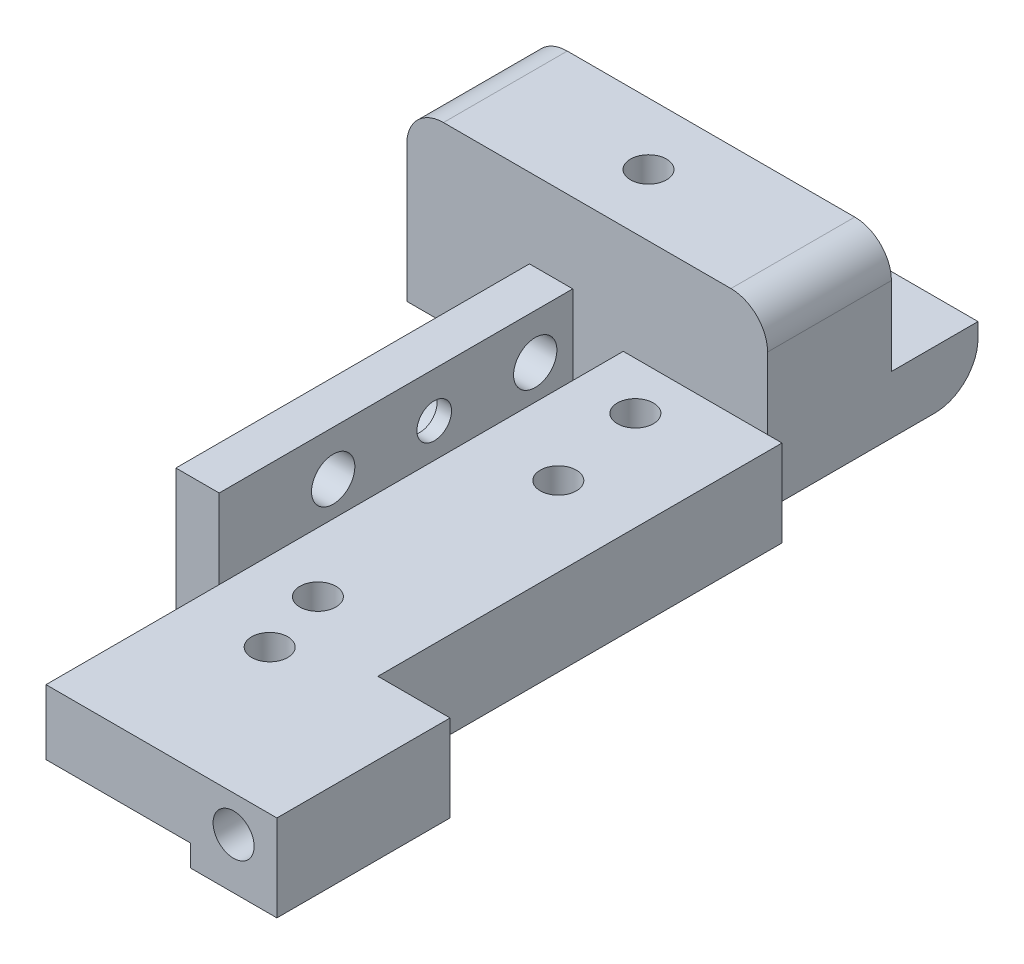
ISO-10303-21;
HEADER;
FILE_DESCRIPTION(('STEP AP214'),'2;1');
FILE_NAME('part.step','',(''),(''),'','','');
FILE_SCHEMA(('AUTOMOTIVE_DESIGN { 1 0 10303 214 1 1 1 1 }'));
ENDSEC;
DATA;
#1=APPLICATION_CONTEXT('core data for automotive mechanical design processes');
#2=APPLICATION_PROTOCOL_DEFINITION('international standard','automotive_design',2000,#1);
#3=PRODUCT_CONTEXT('',#1,'mechanical');
#4=PRODUCT('Part','Part','',(#3));
#5=PRODUCT_RELATED_PRODUCT_CATEGORY('part','',(#4));
#6=PRODUCT_DEFINITION_FORMATION('','',#4);
#7=PRODUCT_DEFINITION_CONTEXT('part definition',#1,'design');
#8=PRODUCT_DEFINITION('design','',#6,#7);
#9=PRODUCT_DEFINITION_SHAPE('','',#8);
#10=(LENGTH_UNIT() NAMED_UNIT(*) SI_UNIT(.MILLI.,.METRE.));
#11=(NAMED_UNIT(*) PLANE_ANGLE_UNIT() SI_UNIT($,.RADIAN.));
#12=(NAMED_UNIT(*) SI_UNIT($,.STERADIAN.) SOLID_ANGLE_UNIT());
#13=UNCERTAINTY_MEASURE_WITH_UNIT(LENGTH_MEASURE(1.E-05),#10,'distance_accuracy_value','');
#14=(GEOMETRIC_REPRESENTATION_CONTEXT(3) GLOBAL_UNCERTAINTY_ASSIGNED_CONTEXT((#13)) GLOBAL_UNIT_ASSIGNED_CONTEXT((#10,
#11,#12)) REPRESENTATION_CONTEXT('',''));
#15=CARTESIAN_POINT('',(0.,0.,0.));
#16=DIRECTION('',(0.,0.,1.));
#17=DIRECTION('',(1.,0.,0.));
#18=AXIS2_PLACEMENT_3D('',#15,#16,#17);
#19=CARTESIAN_POINT('',(11.,4.5,40.));
#20=DIRECTION('',(-1.,0.,0.));
#21=DIRECTION('',(0.,0.,1.));
#22=AXIS2_PLACEMENT_3D('',#19,#20,#21);
#23=PLANE('',#22);
#24=DIRECTION('',(0.,0.,1.));
#25=VECTOR('',#24,1.);
#26=CARTESIAN_POINT('',(11.,-1.5,0.));
#27=LINE('',#26,#25);
#28=CARTESIAN_POINT('',(11.,-1.5,0.));
#29=VERTEX_POINT('',#28);
#30=CARTESIAN_POINT('',(11.,-1.5,28.));
#31=VERTEX_POINT('',#30);
#32=EDGE_CURVE('E230',#29,#31,#27,.T.);
#33=ORIENTED_EDGE('',*,*,#32,.F.);
#34=DIRECTION('',(0.,-1.,0.));
#35=VECTOR('',#34,1.);
#36=CARTESIAN_POINT('',(11.,4.5,0.));
#37=LINE('',#36,#35);
#38=CARTESIAN_POINT('',(11.,4.5,0.));
#39=VERTEX_POINT('',#38);
#40=EDGE_CURVE('E333',#39,#29,#37,.T.);
#41=ORIENTED_EDGE('',*,*,#40,.F.);
#42=DIRECTION('',(0.,0.,-1.));
#43=VECTOR('',#42,1.);
#44=CARTESIAN_POINT('',(11.,4.5,40.));
#45=LINE('',#44,#43);
#46=CARTESIAN_POINT('',(11.,4.5,28.));
#47=VERTEX_POINT('',#46);
#48=EDGE_CURVE('E326',#47,#39,#45,.T.);
#49=ORIENTED_EDGE('',*,*,#48,.F.);
#50=DIRECTION('',(0.,1.,0.));
#51=VECTOR('',#50,1.);
#52=CARTESIAN_POINT('',(11.,-15.,28.));
#53=LINE('',#52,#51);
#54=EDGE_CURVE('E286',#31,#47,#53,.T.);
#55=ORIENTED_EDGE('',*,*,#54,.F.);
#56=EDGE_LOOP('',(#33,#41,#49,#55));
#57=FACE_BOUND('',#56,.T.);
#58=ADVANCED_FACE('F51',(#57),#23,.F.);
#59=CARTESIAN_POINT('',(11.,4.5,0.));
#60=DIRECTION('',(0.,0.,1.));
#61=DIRECTION('',(1.,0.,0.));
#62=AXIS2_PLACEMENT_3D('',#59,#60,#61);
#63=PLANE('',#62);
#64=DIRECTION('',(1.,0.,0.));
#65=VECTOR('',#64,1.);
#66=CARTESIAN_POINT('',(10.,-1.5,0.));
#67=LINE('',#66,#65);
#68=CARTESIAN_POINT('',(10.,-1.5,0.));
#69=VERTEX_POINT('',#68);
#70=EDGE_CURVE('E228',#69,#29,#67,.T.);
#71=ORIENTED_EDGE('',*,*,#70,.F.);
#72=DIRECTION('',(0.,1.,0.));
#73=VECTOR('',#72,1.);
#74=CARTESIAN_POINT('',(10.,-2.,0.));
#75=LINE('',#74,#73);
#76=CARTESIAN_POINT('',(10.,0.,0.));
#77=VERTEX_POINT('',#76);
#78=EDGE_CURVE('E291',#69,#77,#75,.T.);
#79=ORIENTED_EDGE('',*,*,#78,.T.);
#80=DIRECTION('',(0.,-1.,0.));
#81=VECTOR('',#80,1.);
#82=CARTESIAN_POINT('',(10.,0.,0.));
#83=LINE('',#82,#81);
#84=CARTESIAN_POINT('',(10.,4.5,0.));
#85=VERTEX_POINT('',#84);
#86=EDGE_CURVE('E430',#85,#77,#83,.T.);
#87=ORIENTED_EDGE('',*,*,#86,.F.);
#88=DIRECTION('',(-1.,0.,0.));
#89=VECTOR('',#88,1.);
#90=CARTESIAN_POINT('',(11.,4.5,0.));
#91=LINE('',#90,#89);
#92=EDGE_CURVE('E314',#39,#85,#91,.T.);
#93=ORIENTED_EDGE('',*,*,#92,.F.);
#94=ORIENTED_EDGE('',*,*,#40,.T.);
#95=EDGE_LOOP('',(#71,#79,#87,#93,#94));
#96=FACE_BOUND('',#95,.T.);
#97=ADVANCED_FACE('F364',(#96),#63,.F.);
#98=CARTESIAN_POINT('',(0.,4.5,40.));
#99=DIRECTION('',(0.,0.,-1.));
#100=DIRECTION('',(-1.,0.,0.));
#101=AXIS2_PLACEMENT_3D('',#98,#99,#100);
#102=PLANE('',#101);
#103=CARTESIAN_POINT('',(13.,2.,40.));
#104=DIRECTION('',(0.,0.,1.));
#105=DIRECTION('',(1.,0.,0.));
#106=AXIS2_PLACEMENT_3D('',#103,#104,#105);
#107=CIRCLE('',#106,1.42239999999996);
#108=CARTESIAN_POINT('',(14.4224,2.,40.));
#109=VERTEX_POINT('',#108);
#110=EDGE_CURVE('E265',#109,#109,#107,.T.);
#111=ORIENTED_EDGE('',*,*,#110,.F.);
#112=EDGE_LOOP('',(#111));
#113=FACE_BOUND('',#112,.T.);
#114=DIRECTION('',(-1.,0.,0.));
#115=VECTOR('',#114,1.);
#116=CARTESIAN_POINT('',(16.,-1.5,40.));
#117=LINE('',#116,#115);
#118=CARTESIAN_POINT('',(16.,-1.5,40.));
#119=VERTEX_POINT('',#118);
#120=CARTESIAN_POINT('',(10.,-1.5,40.));
#121=VERTEX_POINT('',#120);
#122=EDGE_CURVE('E219',#119,#121,#117,.T.);
#123=ORIENTED_EDGE('',*,*,#122,.F.);
#124=DIRECTION('',(0.,1.,0.));
#125=VECTOR('',#124,1.);
#126=CARTESIAN_POINT('',(16.,-15.,40.));
#127=LINE('',#126,#125);
#128=CARTESIAN_POINT('',(16.,4.5,40.));
#129=VERTEX_POINT('',#128);
#130=EDGE_CURVE('E338',#119,#129,#127,.T.);
#131=ORIENTED_EDGE('',*,*,#130,.T.);
#132=DIRECTION('',(1.,0.,0.));
#133=VECTOR('',#132,1.);
#134=CARTESIAN_POINT('',(0.,4.5,40.));
#135=LINE('',#134,#133);
#136=CARTESIAN_POINT('',(0.,4.5,40.));
#137=VERTEX_POINT('',#136);
#138=EDGE_CURVE('E322',#137,#129,#135,.T.);
#139=ORIENTED_EDGE('',*,*,#138,.F.);
#140=DIRECTION('',(0.,-1.,0.));
#141=VECTOR('',#140,1.);
#142=CARTESIAN_POINT('',(0.,4.5,40.));
#143=LINE('',#142,#141);
#144=CARTESIAN_POINT('',(0.,0.,40.));
#145=VERTEX_POINT('',#144);
#146=EDGE_CURVE('E532',#137,#145,#143,.T.);
#147=ORIENTED_EDGE('',*,*,#146,.T.);
#148=DIRECTION('',(1.,0.,0.));
#149=VECTOR('',#148,1.);
#150=CARTESIAN_POINT('',(0.,0.,40.));
#151=LINE('',#150,#149);
#152=CARTESIAN_POINT('',(10.,0.,40.));
#153=VERTEX_POINT('',#152);
#154=EDGE_CURVE('E301',#145,#153,#151,.T.);
#155=ORIENTED_EDGE('',*,*,#154,.T.);
#156=DIRECTION('',(0.,1.,0.));
#157=VECTOR('',#156,1.);
#158=CARTESIAN_POINT('',(10.,-2.,40.));
#159=LINE('',#158,#157);
#160=EDGE_CURVE('E295',#121,#153,#159,.T.);
#161=ORIENTED_EDGE('',*,*,#160,.F.);
#162=EDGE_LOOP('',(#123,#131,#139,#147,#155,#161));
#163=FACE_BOUND('',#162,.T.);
#164=ADVANCED_FACE('F370',(#113,#163),#102,.F.);
#165=CARTESIAN_POINT('',(10.,-2.,40.));
#166=DIRECTION('',(1.,0.,0.));
#167=DIRECTION('',(0.,0.,-1.));
#168=AXIS2_PLACEMENT_3D('',#165,#166,#167);
#169=PLANE('',#168);
#170=DIRECTION('',(0.,0.,-1.));
#171=VECTOR('',#170,1.);
#172=CARTESIAN_POINT('',(10.,-1.5,40.));
#173=LINE('',#172,#171);
#174=EDGE_CURVE('E222',#121,#69,#173,.T.);
#175=ORIENTED_EDGE('',*,*,#174,.F.);
#176=ORIENTED_EDGE('',*,*,#160,.T.);
#177=DIRECTION('',(0.,0.,-1.));
#178=VECTOR('',#177,1.);
#179=CARTESIAN_POINT('',(10.,0.,40.));
#180=LINE('',#179,#178);
#181=EDGE_CURVE('E304',#153,#77,#180,.T.);
#182=ORIENTED_EDGE('',*,*,#181,.T.);
#183=ORIENTED_EDGE('',*,*,#78,.F.);
#184=EDGE_LOOP('',(#175,#176,#182,#183));
#185=FACE_BOUND('',#184,.T.);
#186=ADVANCED_FACE('F378',(#185),#169,.F.);
#187=CARTESIAN_POINT('',(16.,-15.,40.));
#188=DIRECTION('',(1.,0.,0.));
#189=DIRECTION('',(0.,0.,-1.));
#190=AXIS2_PLACEMENT_3D('',#187,#188,#189);
#191=PLANE('',#190);
#192=ORIENTED_EDGE('',*,*,#130,.F.);
#193=DIRECTION('',(0.,0.,1.));
#194=VECTOR('',#193,1.);
#195=CARTESIAN_POINT('',(16.,-1.5,28.));
#196=LINE('',#195,#194);
#197=CARTESIAN_POINT('',(16.,-1.5,28.));
#198=VERTEX_POINT('',#197);
#199=EDGE_CURVE('E234',#198,#119,#196,.T.);
#200=ORIENTED_EDGE('',*,*,#199,.F.);
#201=DIRECTION('',(0.,1.,0.));
#202=VECTOR('',#201,1.);
#203=CARTESIAN_POINT('',(16.,-15.,28.));
#204=LINE('',#203,#202);
#205=CARTESIAN_POINT('',(16.,4.5,28.));
#206=VERTEX_POINT('',#205);
#207=EDGE_CURVE('E283',#198,#206,#204,.T.);
#208=ORIENTED_EDGE('',*,*,#207,.T.);
#209=DIRECTION('',(0.,0.,-1.));
#210=VECTOR('',#209,1.);
#211=CARTESIAN_POINT('',(16.,4.5,40.));
#212=LINE('',#211,#210);
#213=EDGE_CURVE('E277',#129,#206,#212,.T.);
#214=ORIENTED_EDGE('',*,*,#213,.F.);
#215=EDGE_LOOP('',(#192,#200,#208,#214));
#216=FACE_BOUND('',#215,.T.);
#217=ADVANCED_FACE('F359',(#216),#191,.T.);
#218=CARTESIAN_POINT('',(16.,-15.,28.));
#219=DIRECTION('',(0.,0.,-1.));
#220=DIRECTION('',(-1.,0.,0.));
#221=AXIS2_PLACEMENT_3D('',#218,#219,#220);
#222=PLANE('',#221);
#223=CARTESIAN_POINT('',(13.5,2.,28.));
#224=DIRECTION('',(0.,0.,-1.));
#225=DIRECTION('',(-1.,0.,0.));
#226=AXIS2_PLACEMENT_3D('',#223,#224,#225);
#227=CIRCLE('',#226,1.5875);
#228=CARTESIAN_POINT('',(11.9125,2.,28.));
#229=VERTEX_POINT('',#228);
#230=EDGE_CURVE('E262',#229,#229,#227,.T.);
#231=ORIENTED_EDGE('',*,*,#230,.F.);
#232=EDGE_LOOP('',(#231));
#233=FACE_BOUND('',#232,.T.);
#234=ORIENTED_EDGE('',*,*,#207,.F.);
#235=DIRECTION('',(1.,0.,0.));
#236=VECTOR('',#235,1.);
#237=CARTESIAN_POINT('',(11.,-1.5,28.));
#238=LINE('',#237,#236);
#239=EDGE_CURVE('E232',#31,#198,#238,.T.);
#240=ORIENTED_EDGE('',*,*,#239,.F.);
#241=ORIENTED_EDGE('',*,*,#54,.T.);
#242=DIRECTION('',(-1.,0.,0.));
#243=VECTOR('',#242,1.);
#244=CARTESIAN_POINT('',(16.,4.5,28.));
#245=LINE('',#244,#243);
#246=EDGE_CURVE('E280',#206,#47,#245,.T.);
#247=ORIENTED_EDGE('',*,*,#246,.F.);
#248=EDGE_LOOP('',(#234,#240,#241,#247));
#249=FACE_BOUND('',#248,.T.);
#250=ADVANCED_FACE('F348',(#233,#249),#222,.T.);
#251=CARTESIAN_POINT('',(13.,2.,31.13));
#252=DIRECTION('',(0.,0.,1.));
#253=DIRECTION('',(1.,0.,0.));
#254=AXIS2_PLACEMENT_3D('',#251,#252,#253);
#255=CONICAL_SURFACE('',#254,1.1303,1.02974425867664);
#256=CARTESIAN_POINT('',(13.,2.,31.13));
#257=DIRECTION('',(0.,0.,1.));
#258=DIRECTION('',(1.,0.,0.));
#259=AXIS2_PLACEMENT_3D('',#256,#257,#258);
#260=CIRCLE('',#259,1.1303);
#261=CARTESIAN_POINT('',(14.1303,2.,31.13));
#262=VERTEX_POINT('',#261);
#263=EDGE_CURVE('E274',#262,#262,#260,.T.);
#264=ORIENTED_EDGE('',*,*,#263,.T.);
#265=EDGE_LOOP('',(#264));
#266=FACE_BOUND('',#265,.T.);
#267=CARTESIAN_POINT('',(13.,2.,31.));
#268=DIRECTION('',(0.,0.,-1.));
#269=DIRECTION('',(-1.,0.,0.));
#270=AXIS2_PLACEMENT_3D('',#267,#268,#269);
#271=CIRCLE('',#270,0.913943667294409);
#272=CARTESIAN_POINT('',(12.0860563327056,2.,31.));
#273=VERTEX_POINT('',#272);
#274=EDGE_CURVE('E261',#273,#273,#271,.F.);
#275=ORIENTED_EDGE('',*,*,#274,.F.);
#276=EDGE_LOOP('',(#275));
#277=FACE_BOUND('',#276,.T.);
#278=ADVANCED_FACE('F345',(#266,#277),#255,.F.);
#279=CARTESIAN_POINT('',(0.,4.5,0.));
#280=DIRECTION('',(1.,0.,0.));
#281=DIRECTION('',(0.,0.,-1.));
#282=AXIS2_PLACEMENT_3D('',#279,#280,#281);
#283=PLANE('',#282);
#284=DIRECTION('',(0.,0.,1.));
#285=VECTOR('',#284,1.);
#286=CARTESIAN_POINT('',(0.,4.5,0.));
#287=LINE('',#286,#285);
#288=CARTESIAN_POINT('',(0.,4.5,28.));
#289=VERTEX_POINT('',#288);
#290=EDGE_CURVE('E317',#289,#137,#287,.T.);
#291=ORIENTED_EDGE('',*,*,#290,.F.);
#292=DIRECTION('',(0.,-1.,0.));
#293=VECTOR('',#292,1.);
#294=CARTESIAN_POINT('',(0.,0.,28.));
#295=LINE('',#294,#293);
#296=CARTESIAN_POINT('',(0.,0.,28.));
#297=VERTEX_POINT('',#296);
#298=EDGE_CURVE('E463',#289,#297,#295,.T.);
#299=ORIENTED_EDGE('',*,*,#298,.T.);
#300=DIRECTION('',(0.,0.,1.));
#301=VECTOR('',#300,1.);
#302=CARTESIAN_POINT('',(0.,0.,0.));
#303=LINE('',#302,#301);
#304=EDGE_CURVE('E294',#297,#145,#303,.T.);
#305=ORIENTED_EDGE('',*,*,#304,.T.);
#306=ORIENTED_EDGE('',*,*,#146,.F.);
#307=EDGE_LOOP('',(#291,#299,#305,#306));
#308=FACE_BOUND('',#307,.T.);
#309=ADVANCED_FACE('F347',(#308),#283,.F.);
#310=CARTESIAN_POINT('',(0.,0.,0.));
#311=DIRECTION('',(0.,1.,0.));
#312=DIRECTION('',(0.,0.,1.));
#313=AXIS2_PLACEMENT_3D('',#310,#311,#312);
#314=PLANE('',#313);
#315=CARTESIAN_POINT('',(4.14000000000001,0.,3.3));
#316=DIRECTION('',(0.,1.,0.));
#317=DIRECTION('',(0.,0.,1.));
#318=AXIS2_PLACEMENT_3D('',#315,#316,#317);
#319=CIRCLE('',#318,1.24999999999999);
#320=CARTESIAN_POINT('',(4.14000000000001,0.,4.54999999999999));
#321=VERTEX_POINT('',#320);
#322=EDGE_CURVE('E515',#321,#321,#319,.T.);
#323=ORIENTED_EDGE('',*,*,#322,.T.);
#324=EDGE_LOOP('',(#323));
#325=FACE_BOUND('',#324,.T.);
#326=CARTESIAN_POINT('',(4.14,0.,25.3));
#327=DIRECTION('',(0.,1.,0.));
#328=DIRECTION('',(0.,0.,1.));
#329=AXIS2_PLACEMENT_3D('',#326,#327,#328);
#330=CIRCLE('',#329,1.24999999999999);
#331=CARTESIAN_POINT('',(4.14,0.,26.55));
#332=VERTEX_POINT('',#331);
#333=EDGE_CURVE('E421',#332,#332,#330,.T.);
#334=ORIENTED_EDGE('',*,*,#333,.T.);
#335=EDGE_LOOP('',(#334));
#336=FACE_BOUND('',#335,.T.);
#337=CARTESIAN_POINT('',(5.50000000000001,0.,10.));
#338=DIRECTION('',(0.,-1.,0.));
#339=DIRECTION('',(0.,0.,-1.));
#340=AXIS2_PLACEMENT_3D('',#337,#338,#339);
#341=CIRCLE('',#340,1.24999999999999);
#342=CARTESIAN_POINT('',(5.50000000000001,0.,8.75000000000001));
#343=VERTEX_POINT('',#342);
#344=EDGE_CURVE('E443',#343,#343,#341,.T.);
#345=ORIENTED_EDGE('',*,*,#344,.F.);
#346=EDGE_LOOP('',(#345));
#347=FACE_BOUND('',#346,.T.);
#348=CARTESIAN_POINT('',(5.50000000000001,0.,30.));
#349=DIRECTION('',(0.,-1.,0.));
#350=DIRECTION('',(0.,0.,-1.));
#351=AXIS2_PLACEMENT_3D('',#348,#349,#350);
#352=CIRCLE('',#351,1.24999999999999);
#353=CARTESIAN_POINT('',(5.50000000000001,0.,28.75));
#354=VERTEX_POINT('',#353);
#355=EDGE_CURVE('E669',#354,#354,#352,.T.);
#356=ORIENTED_EDGE('',*,*,#355,.F.);
#357=EDGE_LOOP('',(#356));
#358=FACE_BOUND('',#357,.T.);
#359=DIRECTION('',(0.,0.,1.));
#360=VECTOR('',#359,1.);
#361=CARTESIAN_POINT('',(-15.,0.,-8.58));
#362=LINE('',#361,#360);
#363=CARTESIAN_POINT('',(-15.,0.,-11.58));
#364=VERTEX_POINT('',#363);
#365=CARTESIAN_POINT('',(-15.,0.,0.));
#366=VERTEX_POINT('',#365);
#367=EDGE_CURVE('E411',#364,#366,#362,.T.);
#368=ORIENTED_EDGE('',*,*,#367,.F.);
#369=DIRECTION('',(-1.,0.,0.));
#370=VECTOR('',#369,1.);
#371=CARTESIAN_POINT('',(10.,0.,-11.58));
#372=LINE('',#371,#370);
#373=CARTESIAN_POINT('',(10.,0.,-11.58));
#374=VERTEX_POINT('',#373);
#375=EDGE_CURVE('E446',#364,#374,#372,.F.);
#376=ORIENTED_EDGE('',*,*,#375,.T.);
#377=DIRECTION('',(0.,0.,1.));
#378=VECTOR('',#377,1.);
#379=CARTESIAN_POINT('',(10.,0.,-8.58));
#380=LINE('',#379,#378);
#381=EDGE_CURVE('E440',#374,#77,#380,.T.);
#382=ORIENTED_EDGE('',*,*,#381,.T.);
#383=ORIENTED_EDGE('',*,*,#181,.F.);
#384=ORIENTED_EDGE('',*,*,#154,.F.);
#385=ORIENTED_EDGE('',*,*,#304,.F.);
#386=DIRECTION('',(1.,0.,0.));
#387=VECTOR('',#386,1.);
#388=CARTESIAN_POINT('',(-3.,0.,28.));
#389=LINE('',#388,#387);
#390=CARTESIAN_POINT('',(-3.,0.,28.));
#391=VERTEX_POINT('',#390);
#392=EDGE_CURVE('E495',#391,#297,#389,.T.);
#393=ORIENTED_EDGE('',*,*,#392,.F.);
#394=DIRECTION('',(0.,0.,-1.));
#395=VECTOR('',#394,1.);
#396=CARTESIAN_POINT('',(-3.,0.,28.));
#397=LINE('',#396,#395);
#398=CARTESIAN_POINT('',(-3.,0.,3.5));
#399=VERTEX_POINT('',#398);
#400=EDGE_CURVE('E485',#391,#399,#397,.T.);
#401=ORIENTED_EDGE('',*,*,#400,.T.);
#402=DIRECTION('',(1.,0.,0.));
#403=VECTOR('',#402,1.);
#404=CARTESIAN_POINT('',(-3.,0.,3.5));
#405=LINE('',#404,#403);
#406=CARTESIAN_POINT('',(0.,0.,3.5));
#407=VERTEX_POINT('',#406);
#408=EDGE_CURVE('E510',#399,#407,#405,.T.);
#409=ORIENTED_EDGE('',*,*,#408,.T.);
#410=CARTESIAN_POINT('',(0.,0.,0.));
#411=VERTEX_POINT('',#410);
#412=EDGE_CURVE('E437',#411,#407,#303,.T.);
#413=ORIENTED_EDGE('',*,*,#412,.F.);
#414=DIRECTION('',(-1.,0.,0.));
#415=VECTOR('',#414,1.);
#416=CARTESIAN_POINT('',(-15.,0.,0.));
#417=LINE('',#416,#415);
#418=EDGE_CURVE('E427',#411,#366,#417,.T.);
#419=ORIENTED_EDGE('',*,*,#418,.T.);
#420=EDGE_LOOP('',(#368,#376,#382,#383,#384,#385,#393,#401,#409,#413,#419));
#421=FACE_BOUND('',#420,.T.);
#422=ADVANCED_FACE('F355',(#325,#336,#347,#358,#421),#314,.F.);
#423=ORIENTED_EDGE('',*,*,#412,.T.);
#424=DIRECTION('',(0.,1.,0.));
#425=VECTOR('',#424,1.);
#426=CARTESIAN_POINT('',(0.,0.,3.5));
#427=LINE('',#426,#425);
#428=CARTESIAN_POINT('',(0.,4.5,3.5));
#429=VERTEX_POINT('',#428);
#430=EDGE_CURVE('E499',#407,#429,#427,.T.);
#431=ORIENTED_EDGE('',*,*,#430,.T.);
#432=CARTESIAN_POINT('',(0.,4.5,0.));
#433=VERTEX_POINT('',#432);
#434=EDGE_CURVE('E319',#433,#429,#287,.T.);
#435=ORIENTED_EDGE('',*,*,#434,.F.);
#436=DIRECTION('',(0.,-1.,0.));
#437=VECTOR('',#436,1.);
#438=CARTESIAN_POINT('',(0.,4.5,0.));
#439=LINE('',#438,#437);
#440=EDGE_CURVE('E434',#433,#411,#439,.T.);
#441=ORIENTED_EDGE('',*,*,#440,.T.);
#442=EDGE_LOOP('',(#423,#431,#435,#441));
#443=FACE_BOUND('',#442,.T.);
#444=ADVANCED_FACE('F358',(#443),#283,.F.);
#445=CARTESIAN_POINT('',(0.,4.5,0.));
#446=DIRECTION('',(0.,1.,0.));
#447=DIRECTION('',(0.,0.,1.));
#448=AXIS2_PLACEMENT_3D('',#445,#446,#447);
#449=PLANE('',#448);
#450=CARTESIAN_POINT('',(4.14000000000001,4.5,3.3));
#451=DIRECTION('',(0.,1.,0.));
#452=DIRECTION('',(0.,0.,1.));
#453=AXIS2_PLACEMENT_3D('',#450,#451,#452);
#454=CIRCLE('',#453,1.24999999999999);
#455=CARTESIAN_POINT('',(4.14000000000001,4.5,4.54999999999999));
#456=VERTEX_POINT('',#455);
#457=EDGE_CURVE('E506',#456,#456,#454,.T.);
#458=ORIENTED_EDGE('',*,*,#457,.F.);
#459=EDGE_LOOP('',(#458));
#460=FACE_BOUND('',#459,.T.);
#461=CARTESIAN_POINT('',(4.14,4.5,25.3));
#462=DIRECTION('',(0.,1.,0.));
#463=DIRECTION('',(0.,0.,1.));
#464=AXIS2_PLACEMENT_3D('',#461,#462,#463);
#465=CIRCLE('',#464,1.24999999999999);
#466=CARTESIAN_POINT('',(4.14,4.5,26.55));
#467=VERTEX_POINT('',#466);
#468=EDGE_CURVE('E516',#467,#467,#465,.T.);
#469=ORIENTED_EDGE('',*,*,#468,.F.);
#470=EDGE_LOOP('',(#469));
#471=FACE_BOUND('',#470,.T.);
#472=CARTESIAN_POINT('',(5.50000000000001,4.5,10.));
#473=DIRECTION('',(0.,1.,0.));
#474=DIRECTION('',(0.,0.,1.));
#475=AXIS2_PLACEMENT_3D('',#472,#473,#474);
#476=CIRCLE('',#475,1.24999999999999);
#477=CARTESIAN_POINT('',(5.50000000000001,4.5,11.25));
#478=VERTEX_POINT('',#477);
#479=EDGE_CURVE('E666',#478,#478,#476,.T.);
#480=ORIENTED_EDGE('',*,*,#479,.F.);
#481=EDGE_LOOP('',(#480));
#482=FACE_BOUND('',#481,.T.);
#483=CARTESIAN_POINT('',(5.50000000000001,4.5,30.));
#484=DIRECTION('',(0.,1.,0.));
#485=DIRECTION('',(0.,0.,1.));
#486=AXIS2_PLACEMENT_3D('',#483,#484,#485);
#487=CIRCLE('',#486,1.24999999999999);
#488=CARTESIAN_POINT('',(5.50000000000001,4.5,31.25));
#489=VERTEX_POINT('',#488);
#490=EDGE_CURVE('E307',#489,#489,#487,.T.);
#491=ORIENTED_EDGE('',*,*,#490,.F.);
#492=EDGE_LOOP('',(#491));
#493=FACE_BOUND('',#492,.T.);
#494=ORIENTED_EDGE('',*,*,#92,.T.);
#495=EDGE_CURVE('E318',#85,#433,#91,.T.);
#496=ORIENTED_EDGE('',*,*,#495,.T.);
#497=ORIENTED_EDGE('',*,*,#434,.T.);
#498=EDGE_CURVE('E323',#429,#289,#287,.T.);
#499=ORIENTED_EDGE('',*,*,#498,.T.);
#500=ORIENTED_EDGE('',*,*,#290,.T.);
#501=ORIENTED_EDGE('',*,*,#138,.T.);
#502=ORIENTED_EDGE('',*,*,#213,.T.);
#503=ORIENTED_EDGE('',*,*,#246,.T.);
#504=ORIENTED_EDGE('',*,*,#48,.T.);
#505=EDGE_LOOP('',(#494,#496,#497,#499,#500,#501,#502,#503,#504));
#506=FACE_BOUND('',#505,.T.);
#507=ADVANCED_FACE('F381',(#460,#471,#482,#493,#506),#449,.T.);
#508=CARTESIAN_POINT('',(5.50000000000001,0.,30.));
#509=DIRECTION('',(0.,-1.,0.));
#510=DIRECTION('',(0.,0.,-1.));
#511=AXIS2_PLACEMENT_3D('',#508,#509,#510);
#512=CYLINDRICAL_SURFACE('',#511,1.24999999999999);
#513=ORIENTED_EDGE('',*,*,#490,.T.);
#514=EDGE_LOOP('',(#513));
#515=FACE_BOUND('',#514,.T.);
#516=ORIENTED_EDGE('',*,*,#355,.T.);
#517=EDGE_LOOP('',(#516));
#518=FACE_BOUND('',#517,.T.);
#519=ADVANCED_FACE('F650',(#515,#518),#512,.F.);
#520=CARTESIAN_POINT('',(5.50000000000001,0.,10.));
#521=DIRECTION('',(0.,-1.,0.));
#522=DIRECTION('',(0.,0.,-1.));
#523=AXIS2_PLACEMENT_3D('',#520,#521,#522);
#524=CYLINDRICAL_SURFACE('',#523,1.24999999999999);
#525=ORIENTED_EDGE('',*,*,#479,.T.);
#526=EDGE_LOOP('',(#525));
#527=FACE_BOUND('',#526,.T.);
#528=ORIENTED_EDGE('',*,*,#344,.T.);
#529=EDGE_LOOP('',(#528));
#530=FACE_BOUND('',#529,.T.);
#531=ADVANCED_FACE('F647',(#527,#530),#524,.F.);
#532=CARTESIAN_POINT('',(-15.,0.,-8.58));
#533=DIRECTION('',(1.,0.,0.));
#534=DIRECTION('',(0.,0.,-1.));
#535=AXIS2_PLACEMENT_3D('',#532,#533,#534);
#536=PLANE('',#535);
#537=DIRECTION('',(0.,1.,0.));
#538=VECTOR('',#537,1.);
#539=CARTESIAN_POINT('',(-15.,0.,0.));
#540=LINE('',#539,#538);
#541=CARTESIAN_POINT('',(-15.,9.46,0.));
#542=VERTEX_POINT('',#541);
#543=EDGE_CURVE('E418',#366,#542,#540,.T.);
#544=ORIENTED_EDGE('',*,*,#543,.T.);
#545=DIRECTION('',(0.,0.,1.));
#546=VECTOR('',#545,1.);
#547=CARTESIAN_POINT('',(-15.,9.46,-8.58));
#548=LINE('',#547,#546);
#549=CARTESIAN_POINT('',(-15.,9.46,-8.58));
#550=VERTEX_POINT('',#549);
#551=EDGE_CURVE('E74',#542,#550,#548,.F.);
#552=ORIENTED_EDGE('',*,*,#551,.T.);
#553=DIRECTION('',(0.,1.,0.));
#554=VECTOR('',#553,1.);
#555=CARTESIAN_POINT('',(-15.,0.,-8.58));
#556=LINE('',#555,#554);
#557=CARTESIAN_POINT('',(-15.,4.,-8.58));
#558=VERTEX_POINT('',#557);
#559=EDGE_CURVE('E476',#558,#550,#556,.T.);
#560=ORIENTED_EDGE('',*,*,#559,.F.);
#561=DIRECTION('',(0.,0.,1.));
#562=VECTOR('',#561,1.);
#563=CARTESIAN_POINT('',(-15.,4.,-14.58));
#564=LINE('',#563,#562);
#565=CARTESIAN_POINT('',(-15.,4.,-14.58));
#566=VERTEX_POINT('',#565);
#567=EDGE_CURVE('E460',#566,#558,#564,.T.);
#568=ORIENTED_EDGE('',*,*,#567,.F.);
#569=DIRECTION('',(0.,1.,0.));
#570=VECTOR('',#569,1.);
#571=CARTESIAN_POINT('',(-15.,4.,-14.58));
#572=LINE('',#571,#570);
#573=CARTESIAN_POINT('',(-15.,3.,-14.58));
#574=VERTEX_POINT('',#573);
#575=EDGE_CURVE('E572',#574,#566,#572,.T.);
#576=ORIENTED_EDGE('',*,*,#575,.F.);
#577=CARTESIAN_POINT('',(-15.,3.,-11.58));
#578=DIRECTION('',(1.,0.,0.));
#579=DIRECTION('',(0.,0.,-1.));
#580=AXIS2_PLACEMENT_3D('',#577,#578,#579);
#581=CIRCLE('',#580,3.);
#582=EDGE_CURVE('E444',#574,#364,#581,.F.);
#583=ORIENTED_EDGE('',*,*,#582,.T.);
#584=ORIENTED_EDGE('',*,*,#367,.T.);
#585=EDGE_LOOP('',(#544,#552,#560,#568,#576,#583,#584));
#586=FACE_BOUND('',#585,.T.);
#587=ADVANCED_FACE('F643',(#586),#536,.F.);
#588=CARTESIAN_POINT('',(-15.,12.,-8.58));
#589=DIRECTION('',(0.,-1.,0.));
#590=DIRECTION('',(1.,0.,0.));
#591=AXIS2_PLACEMENT_3D('',#588,#589,#590);
#592=PLANE('',#591);
#593=CARTESIAN_POINT('',(-2.54,12.,-4.29));
#594=DIRECTION('',(0.,1.,0.));
#595=DIRECTION('',(0.,0.,1.));
#596=AXIS2_PLACEMENT_3D('',#593,#594,#595);
#597=CIRCLE('',#596,1.24999999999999);
#598=CARTESIAN_POINT('',(-2.54,12.,-3.04000000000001));
#599=VERTEX_POINT('',#598);
#600=EDGE_CURVE('E220',#599,#599,#597,.T.);
#601=ORIENTED_EDGE('',*,*,#600,.F.);
#602=EDGE_LOOP('',(#601));
#603=FACE_BOUND('',#602,.T.);
#604=DIRECTION('',(1.,0.,0.));
#605=VECTOR('',#604,1.);
#606=CARTESIAN_POINT('',(-15.,12.,-8.58));
#607=LINE('',#606,#605);
#608=CARTESIAN_POINT('',(-12.46,12.,-8.58));
#609=VERTEX_POINT('',#608);
#610=CARTESIAN_POINT('',(7.46,12.,-8.58));
#611=VERTEX_POINT('',#610);
#612=EDGE_CURVE('E412',#609,#611,#607,.T.);
#613=ORIENTED_EDGE('',*,*,#612,.F.);
#614=DIRECTION('',(0.,0.,1.));
#615=VECTOR('',#614,1.);
#616=CARTESIAN_POINT('',(-12.46,12.,-8.58));
#617=LINE('',#616,#615);
#618=CARTESIAN_POINT('',(-12.46,12.,0.));
#619=VERTEX_POINT('',#618);
#620=EDGE_CURVE('E404',#609,#619,#617,.T.);
#621=ORIENTED_EDGE('',*,*,#620,.T.);
#622=DIRECTION('',(1.,0.,0.));
#623=VECTOR('',#622,1.);
#624=CARTESIAN_POINT('',(-15.,12.,0.));
#625=LINE('',#624,#623);
#626=CARTESIAN_POINT('',(7.46,12.,0.));
#627=VERTEX_POINT('',#626);
#628=EDGE_CURVE('E420',#619,#627,#625,.T.);
#629=ORIENTED_EDGE('',*,*,#628,.T.);
#630=DIRECTION('',(0.,0.,1.));
#631=VECTOR('',#630,1.);
#632=CARTESIAN_POINT('',(7.46,12.,-8.58));
#633=LINE('',#632,#631);
#634=EDGE_CURVE('E451',#627,#611,#633,.F.);
#635=ORIENTED_EDGE('',*,*,#634,.T.);
#636=EDGE_LOOP('',(#613,#621,#629,#635));
#637=FACE_BOUND('',#636,.T.);
#638=ADVANCED_FACE('F640',(#603,#637),#592,.F.);
#639=CARTESIAN_POINT('',(10.,0.,-8.58));
#640=DIRECTION('',(-1.,0.,0.));
#641=DIRECTION('',(0.,0.,1.));
#642=AXIS2_PLACEMENT_3D('',#639,#640,#641);
#643=PLANE('',#642);
#644=DIRECTION('',(0.,-1.,0.));
#645=VECTOR('',#644,1.);
#646=CARTESIAN_POINT('',(10.,0.,-8.58));
#647=LINE('',#646,#645);
#648=CARTESIAN_POINT('',(10.,9.46,-8.58));
#649=VERTEX_POINT('',#648);
#650=CARTESIAN_POINT('',(10.,4.,-8.58));
#651=VERTEX_POINT('',#650);
#652=EDGE_CURVE('E408',#649,#651,#647,.T.);
#653=ORIENTED_EDGE('',*,*,#652,.F.);
#654=DIRECTION('',(0.,0.,1.));
#655=VECTOR('',#654,1.);
#656=CARTESIAN_POINT('',(10.,9.46,-8.58));
#657=LINE('',#656,#655);
#658=CARTESIAN_POINT('',(10.,9.46,0.));
#659=VERTEX_POINT('',#658);
#660=EDGE_CURVE('E14',#649,#659,#657,.T.);
#661=ORIENTED_EDGE('',*,*,#660,.T.);
#662=EDGE_CURVE('E424',#659,#85,#83,.T.);
#663=ORIENTED_EDGE('',*,*,#662,.T.);
#664=ORIENTED_EDGE('',*,*,#86,.T.);
#665=ORIENTED_EDGE('',*,*,#381,.F.);
#666=CARTESIAN_POINT('',(10.,3.,-11.58));
#667=DIRECTION('',(-1.,0.,0.));
#668=DIRECTION('',(0.,0.,1.));
#669=AXIS2_PLACEMENT_3D('',#666,#667,#668);
#670=CIRCLE('',#669,3.);
#671=CARTESIAN_POINT('',(10.,3.,-14.58));
#672=VERTEX_POINT('',#671);
#673=EDGE_CURVE('E334',#374,#672,#670,.F.);
#674=ORIENTED_EDGE('',*,*,#673,.T.);
#675=DIRECTION('',(0.,-1.,0.));
#676=VECTOR('',#675,1.);
#677=CARTESIAN_POINT('',(10.,4.,-14.58));
#678=LINE('',#677,#676);
#679=CARTESIAN_POINT('',(10.,4.,-14.58));
#680=VERTEX_POINT('',#679);
#681=EDGE_CURVE('E474',#680,#672,#678,.T.);
#682=ORIENTED_EDGE('',*,*,#681,.F.);
#683=DIRECTION('',(0.,0.,1.));
#684=VECTOR('',#683,1.);
#685=CARTESIAN_POINT('',(10.,4.,-14.58));
#686=LINE('',#685,#684);
#687=EDGE_CURVE('E464',#680,#651,#686,.T.);
#688=ORIENTED_EDGE('',*,*,#687,.T.);
#689=EDGE_LOOP('',(#653,#661,#663,#664,#665,#674,#682,#688));
#690=FACE_BOUND('',#689,.T.);
#691=ADVANCED_FACE('F580',(#690),#643,.F.);
#692=CARTESIAN_POINT('',(0.,0.,-8.58));
#693=DIRECTION('',(0.,0.,-1.));
#694=DIRECTION('',(-1.,0.,0.));
#695=AXIS2_PLACEMENT_3D('',#692,#693,#694);
#696=PLANE('',#695);
#697=CARTESIAN_POINT('',(5.50000000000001,8.,-8.58));
#698=DIRECTION('',(0.,0.,-1.));
#699=DIRECTION('',(-1.,0.,0.));
#700=AXIS2_PLACEMENT_3D('',#697,#698,#699);
#701=CIRCLE('',#700,1.24999999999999);
#702=CARTESIAN_POINT('',(4.25000000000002,8.,-8.58));
#703=VERTEX_POINT('',#702);
#704=EDGE_CURVE('E289',#703,#703,#701,.T.);
#705=ORIENTED_EDGE('',*,*,#704,.F.);
#706=EDGE_LOOP('',(#705));
#707=FACE_BOUND('',#706,.T.);
#708=CARTESIAN_POINT('',(-10.5,8.,-8.58));
#709=DIRECTION('',(0.,0.,-1.));
#710=DIRECTION('',(-1.,0.,0.));
#711=AXIS2_PLACEMENT_3D('',#708,#709,#710);
#712=CIRCLE('',#711,1.24999999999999);
#713=CARTESIAN_POINT('',(-11.75,8.,-8.58));
#714=VERTEX_POINT('',#713);
#715=EDGE_CURVE('E567',#714,#714,#712,.T.);
#716=ORIENTED_EDGE('',*,*,#715,.F.);
#717=EDGE_LOOP('',(#716));
#718=FACE_BOUND('',#717,.T.);
#719=ORIENTED_EDGE('',*,*,#559,.T.);
#720=CARTESIAN_POINT('',(-12.46,9.46,-8.58));
#721=DIRECTION('',(0.,0.,-1.));
#722=DIRECTION('',(-1.,0.,0.));
#723=AXIS2_PLACEMENT_3D('',#720,#721,#722);
#724=CIRCLE('',#723,2.54);
#725=EDGE_CURVE('E59',#550,#609,#724,.T.);
#726=ORIENTED_EDGE('',*,*,#725,.T.);
#727=ORIENTED_EDGE('',*,*,#612,.T.);
#728=CARTESIAN_POINT('',(7.46,9.46,-8.58));
#729=DIRECTION('',(0.,0.,-1.));
#730=DIRECTION('',(-1.,0.,0.));
#731=AXIS2_PLACEMENT_3D('',#728,#729,#730);
#732=CIRCLE('',#731,2.54);
#733=EDGE_CURVE('E66',#611,#649,#732,.T.);
#734=ORIENTED_EDGE('',*,*,#733,.T.);
#735=ORIENTED_EDGE('',*,*,#652,.T.);
#736=DIRECTION('',(1.,0.,0.));
#737=VECTOR('',#736,1.);
#738=CARTESIAN_POINT('',(10.,4.,-8.58));
#739=LINE('',#738,#737);
#740=EDGE_CURVE('E470',#558,#651,#739,.T.);
#741=ORIENTED_EDGE('',*,*,#740,.F.);
#742=EDGE_LOOP('',(#719,#726,#727,#734,#735,#741));
#743=FACE_BOUND('',#742,.T.);
#744=ADVANCED_FACE('F631',(#707,#718,#743),#696,.T.);
#745=CARTESIAN_POINT('',(0.,0.,0.));
#746=DIRECTION('',(0.,0.,-1.));
#747=DIRECTION('',(-1.,0.,0.));
#748=AXIS2_PLACEMENT_3D('',#745,#746,#747);
#749=PLANE('',#748);
#750=ORIENTED_EDGE('',*,*,#628,.F.);
#751=CARTESIAN_POINT('',(-12.46,9.46,0.));
#752=DIRECTION('',(0.,0.,-1.));
#753=DIRECTION('',(-1.,0.,0.));
#754=AXIS2_PLACEMENT_3D('',#751,#752,#753);
#755=CIRCLE('',#754,2.54);
#756=EDGE_CURVE('E678',#619,#542,#755,.F.);
#757=ORIENTED_EDGE('',*,*,#756,.T.);
#758=ORIENTED_EDGE('',*,*,#543,.F.);
#759=ORIENTED_EDGE('',*,*,#418,.F.);
#760=ORIENTED_EDGE('',*,*,#440,.F.);
#761=ORIENTED_EDGE('',*,*,#495,.F.);
#762=ORIENTED_EDGE('',*,*,#662,.F.);
#763=CARTESIAN_POINT('',(7.46,9.46,0.));
#764=DIRECTION('',(0.,0.,-1.));
#765=DIRECTION('',(-1.,0.,0.));
#766=AXIS2_PLACEMENT_3D('',#763,#764,#765);
#767=CIRCLE('',#766,2.54);
#768=EDGE_CURVE('E679',#659,#627,#767,.F.);
#769=ORIENTED_EDGE('',*,*,#768,.T.);
#770=EDGE_LOOP('',(#750,#757,#758,#759,#760,#761,#762,#769));
#771=FACE_BOUND('',#770,.T.);
#772=ADVANCED_FACE('F630',(#771),#749,.F.);
#773=CARTESIAN_POINT('',(4.14,4.5,25.3));
#774=DIRECTION('',(0.,1.,0.));
#775=DIRECTION('',(0.,0.,1.));
#776=AXIS2_PLACEMENT_3D('',#773,#774,#775);
#777=CYLINDRICAL_SURFACE('',#776,1.24999999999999);
#778=ORIENTED_EDGE('',*,*,#468,.T.);
#779=EDGE_LOOP('',(#778));
#780=FACE_BOUND('',#779,.T.);
#781=ORIENTED_EDGE('',*,*,#333,.F.);
#782=EDGE_LOOP('',(#781));
#783=FACE_BOUND('',#782,.T.);
#784=ADVANCED_FACE('F626',(#780,#783),#777,.F.);
#785=CARTESIAN_POINT('',(4.14000000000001,4.5,3.3));
#786=DIRECTION('',(0.,1.,0.));
#787=DIRECTION('',(0.,0.,1.));
#788=AXIS2_PLACEMENT_3D('',#785,#786,#787);
#789=CYLINDRICAL_SURFACE('',#788,1.24999999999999);
#790=ORIENTED_EDGE('',*,*,#457,.T.);
#791=EDGE_LOOP('',(#790));
#792=FACE_BOUND('',#791,.T.);
#793=ORIENTED_EDGE('',*,*,#322,.F.);
#794=EDGE_LOOP('',(#793));
#795=FACE_BOUND('',#794,.T.);
#796=ADVANCED_FACE('F619',(#792,#795),#789,.F.);
#797=CARTESIAN_POINT('',(-3.,0.,28.));
#798=DIRECTION('',(0.,0.,1.));
#799=DIRECTION('',(1.,0.,0.));
#800=AXIS2_PLACEMENT_3D('',#797,#798,#799);
#801=PLANE('',#800);
#802=CARTESIAN_POINT('',(0.,10.,28.));
#803=VERTEX_POINT('',#802);
#804=EDGE_CURVE('E496',#803,#289,#295,.T.);
#805=ORIENTED_EDGE('',*,*,#804,.F.);
#806=DIRECTION('',(1.,0.,0.));
#807=VECTOR('',#806,1.);
#808=CARTESIAN_POINT('',(-3.,10.,28.));
#809=LINE('',#808,#807);
#810=CARTESIAN_POINT('',(-3.,10.,28.));
#811=VERTEX_POINT('',#810);
#812=EDGE_CURVE('E504',#811,#803,#809,.T.);
#813=ORIENTED_EDGE('',*,*,#812,.F.);
#814=DIRECTION('',(0.,-1.,0.));
#815=VECTOR('',#814,1.);
#816=CARTESIAN_POINT('',(-3.,0.,28.));
#817=LINE('',#816,#815);
#818=EDGE_CURVE('E482',#811,#391,#817,.T.);
#819=ORIENTED_EDGE('',*,*,#818,.T.);
#820=ORIENTED_EDGE('',*,*,#392,.T.);
#821=ORIENTED_EDGE('',*,*,#298,.F.);
#822=EDGE_LOOP('',(#805,#813,#819,#820,#821));
#823=FACE_BOUND('',#822,.T.);
#824=ADVANCED_FACE('F609',(#823),#801,.T.);
#825=CARTESIAN_POINT('',(-3.,10.,28.));
#826=DIRECTION('',(0.,1.,0.));
#827=DIRECTION('',(0.,0.,1.));
#828=AXIS2_PLACEMENT_3D('',#825,#826,#827);
#829=PLANE('',#828);
#830=DIRECTION('',(0.,0.,1.));
#831=VECTOR('',#830,1.);
#832=CARTESIAN_POINT('',(0.,10.,28.));
#833=LINE('',#832,#831);
#834=CARTESIAN_POINT('',(0.,10.,3.5));
#835=VERTEX_POINT('',#834);
#836=EDGE_CURVE('E486',#835,#803,#833,.T.);
#837=ORIENTED_EDGE('',*,*,#836,.F.);
#838=DIRECTION('',(1.,0.,0.));
#839=VECTOR('',#838,1.);
#840=CARTESIAN_POINT('',(-3.,10.,3.5));
#841=LINE('',#840,#839);
#842=CARTESIAN_POINT('',(-3.,10.,3.5));
#843=VERTEX_POINT('',#842);
#844=EDGE_CURVE('E507',#843,#835,#841,.T.);
#845=ORIENTED_EDGE('',*,*,#844,.F.);
#846=DIRECTION('',(0.,0.,1.));
#847=VECTOR('',#846,1.);
#848=CARTESIAN_POINT('',(-3.,10.,28.));
#849=LINE('',#848,#847);
#850=EDGE_CURVE('E492',#843,#811,#849,.T.);
#851=ORIENTED_EDGE('',*,*,#850,.T.);
#852=ORIENTED_EDGE('',*,*,#812,.T.);
#853=EDGE_LOOP('',(#837,#845,#851,#852));
#854=FACE_BOUND('',#853,.T.);
#855=ADVANCED_FACE('F611',(#854),#829,.T.);
#856=CARTESIAN_POINT('',(-3.,0.,3.5));
#857=DIRECTION('',(0.,0.,-1.));
#858=DIRECTION('',(-1.,0.,0.));
#859=AXIS2_PLACEMENT_3D('',#856,#857,#858);
#860=PLANE('',#859);
#861=ORIENTED_EDGE('',*,*,#430,.F.);
#862=ORIENTED_EDGE('',*,*,#408,.F.);
#863=DIRECTION('',(0.,1.,0.));
#864=VECTOR('',#863,1.);
#865=CARTESIAN_POINT('',(-3.,0.,3.5));
#866=LINE('',#865,#864);
#867=EDGE_CURVE('E489',#399,#843,#866,.T.);
#868=ORIENTED_EDGE('',*,*,#867,.T.);
#869=ORIENTED_EDGE('',*,*,#844,.T.);
#870=EDGE_CURVE('E498',#429,#835,#427,.T.);
#871=ORIENTED_EDGE('',*,*,#870,.F.);
#872=EDGE_LOOP('',(#861,#862,#868,#869,#871));
#873=FACE_BOUND('',#872,.T.);
#874=ADVANCED_FACE('F594',(#873),#860,.T.);
#875=CARTESIAN_POINT('',(-3.,0.,0.));
#876=DIRECTION('',(-1.,0.,0.));
#877=DIRECTION('',(0.,0.,1.));
#878=AXIS2_PLACEMENT_3D('',#875,#876,#877);
#879=PLANE('',#878);
#880=CARTESIAN_POINT('',(-3.,6.88125,6.10000000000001));
#881=DIRECTION('',(-1.,0.,0.));
#882=DIRECTION('',(0.,0.,1.));
#883=AXIS2_PLACEMENT_3D('',#880,#881,#882);
#884=CIRCLE('',#883,1.5);
#885=CARTESIAN_POINT('',(-3.,6.88125,7.60000000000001));
#886=VERTEX_POINT('',#885);
#887=EDGE_CURVE('E236',#886,#886,#884,.T.);
#888=ORIENTED_EDGE('',*,*,#887,.F.);
#889=EDGE_LOOP('',(#888));
#890=FACE_BOUND('',#889,.T.);
#891=CARTESIAN_POINT('',(-3.,6.88125,20.1));
#892=DIRECTION('',(-1.,0.,0.));
#893=DIRECTION('',(0.,0.,1.));
#894=AXIS2_PLACEMENT_3D('',#891,#892,#893);
#895=CIRCLE('',#894,1.5);
#896=CARTESIAN_POINT('',(-3.,6.88125,21.6));
#897=VERTEX_POINT('',#896);
#898=EDGE_CURVE('E242',#897,#897,#895,.T.);
#899=ORIENTED_EDGE('',*,*,#898,.F.);
#900=EDGE_LOOP('',(#899));
#901=FACE_BOUND('',#900,.T.);
#902=CARTESIAN_POINT('',(-3.,6.88124999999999,13.1));
#903=DIRECTION('',(-1.,0.,0.));
#904=DIRECTION('',(0.,0.,1.));
#905=AXIS2_PLACEMENT_3D('',#902,#903,#904);
#906=CIRCLE('',#905,2.19999999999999);
#907=CARTESIAN_POINT('',(-3.,6.88124999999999,15.3));
#908=VERTEX_POINT('',#907);
#909=EDGE_CURVE('E248',#908,#908,#906,.T.);
#910=ORIENTED_EDGE('',*,*,#909,.F.);
#911=EDGE_LOOP('',(#910));
#912=FACE_BOUND('',#911,.T.);
#913=ORIENTED_EDGE('',*,*,#818,.F.);
#914=ORIENTED_EDGE('',*,*,#850,.F.);
#915=ORIENTED_EDGE('',*,*,#867,.F.);
#916=ORIENTED_EDGE('',*,*,#400,.F.);
#917=EDGE_LOOP('',(#913,#914,#915,#916));
#918=FACE_BOUND('',#917,.T.);
#919=ADVANCED_FACE('F607',(#890,#901,#912,#918),#879,.T.);
#920=CARTESIAN_POINT('',(0.,0.,0.));
#921=DIRECTION('',(-1.,0.,0.));
#922=DIRECTION('',(0.,0.,1.));
#923=AXIS2_PLACEMENT_3D('',#920,#921,#922);
#924=PLANE('',#923);
#925=CARTESIAN_POINT('',(0.,6.88125,6.10000000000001));
#926=DIRECTION('',(-1.,0.,0.));
#927=DIRECTION('',(0.,0.,1.));
#928=AXIS2_PLACEMENT_3D('',#925,#926,#927);
#929=CIRCLE('',#928,1.5);
#930=CARTESIAN_POINT('',(0.,6.88125,7.60000000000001));
#931=VERTEX_POINT('',#930);
#932=EDGE_CURVE('E239',#931,#931,#929,.T.);
#933=ORIENTED_EDGE('',*,*,#932,.T.);
#934=EDGE_LOOP('',(#933));
#935=FACE_BOUND('',#934,.T.);
#936=CARTESIAN_POINT('',(0.,6.88125,20.1));
#937=DIRECTION('',(-1.,0.,0.));
#938=DIRECTION('',(0.,0.,1.));
#939=AXIS2_PLACEMENT_3D('',#936,#937,#938);
#940=CIRCLE('',#939,1.5);
#941=CARTESIAN_POINT('',(0.,6.88125,21.6));
#942=VERTEX_POINT('',#941);
#943=EDGE_CURVE('E245',#942,#942,#940,.T.);
#944=ORIENTED_EDGE('',*,*,#943,.T.);
#945=EDGE_LOOP('',(#944));
#946=FACE_BOUND('',#945,.T.);
#947=CARTESIAN_POINT('',(0.,6.88124999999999,13.1));
#948=DIRECTION('',(-1.,0.,0.));
#949=DIRECTION('',(0.,0.,1.));
#950=AXIS2_PLACEMENT_3D('',#947,#948,#949);
#951=CIRCLE('',#950,1.2);
#952=CARTESIAN_POINT('',(0.,6.88124999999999,14.3));
#953=VERTEX_POINT('',#952);
#954=EDGE_CURVE('E257',#953,#953,#951,.T.);
#955=ORIENTED_EDGE('',*,*,#954,.T.);
#956=EDGE_LOOP('',(#955));
#957=FACE_BOUND('',#956,.T.);
#958=ORIENTED_EDGE('',*,*,#498,.F.);
#959=ORIENTED_EDGE('',*,*,#870,.T.);
#960=ORIENTED_EDGE('',*,*,#836,.T.);
#961=ORIENTED_EDGE('',*,*,#804,.T.);
#962=EDGE_LOOP('',(#958,#959,#960,#961));
#963=FACE_BOUND('',#962,.T.);
#964=ADVANCED_FACE('F597',(#935,#946,#957,#963),#924,.F.);
#965=CARTESIAN_POINT('',(10.,4.,-14.58));
#966=DIRECTION('',(0.,-1.,0.));
#967=DIRECTION('',(0.,0.,-1.));
#968=AXIS2_PLACEMENT_3D('',#965,#966,#967);
#969=PLANE('',#968);
#970=ORIENTED_EDGE('',*,*,#740,.T.);
#971=ORIENTED_EDGE('',*,*,#687,.F.);
#972=DIRECTION('',(1.,0.,0.));
#973=VECTOR('',#972,1.);
#974=CARTESIAN_POINT('',(10.,4.,-14.58));
#975=LINE('',#974,#973);
#976=EDGE_CURVE('E469',#566,#680,#975,.T.);
#977=ORIENTED_EDGE('',*,*,#976,.F.);
#978=ORIENTED_EDGE('',*,*,#567,.T.);
#979=EDGE_LOOP('',(#970,#971,#977,#978));
#980=FACE_BOUND('',#979,.T.);
#981=ADVANCED_FACE('F578',(#980),#969,.F.);
#982=CARTESIAN_POINT('',(0.,0.,-14.58));
#983=DIRECTION('',(0.,0.,-1.));
#984=DIRECTION('',(-1.,0.,0.));
#985=AXIS2_PLACEMENT_3D('',#982,#983,#984);
#986=PLANE('',#985);
#987=ORIENTED_EDGE('',*,*,#681,.T.);
#988=DIRECTION('',(-1.,0.,0.));
#989=VECTOR('',#988,1.);
#990=CARTESIAN_POINT('',(-15.,3.,-14.58));
#991=LINE('',#990,#989);
#992=EDGE_CURVE('E433',#672,#574,#991,.T.);
#993=ORIENTED_EDGE('',*,*,#992,.T.);
#994=ORIENTED_EDGE('',*,*,#575,.T.);
#995=ORIENTED_EDGE('',*,*,#976,.T.);
#996=EDGE_LOOP('',(#987,#993,#994,#995));
#997=FACE_BOUND('',#996,.T.);
#998=ADVANCED_FACE('F387',(#997),#986,.T.);
#999=CARTESIAN_POINT('',(0.,3.,-11.58));
#1000=DIRECTION('',(1.,0.,0.));
#1001=DIRECTION('',(0.,0.,-1.));
#1002=AXIS2_PLACEMENT_3D('',#999,#1000,#1001);
#1003=CYLINDRICAL_SURFACE('',#1002,3.);
#1004=ORIENTED_EDGE('',*,*,#673,.F.);
#1005=ORIENTED_EDGE('',*,*,#375,.F.);
#1006=ORIENTED_EDGE('',*,*,#582,.F.);
#1007=ORIENTED_EDGE('',*,*,#992,.F.);
#1008=EDGE_LOOP('',(#1004,#1005,#1006,#1007));
#1009=FACE_BOUND('',#1008,.T.);
#1010=ADVANCED_FACE('F384',(#1009),#1003,.T.);
#1011=CARTESIAN_POINT('',(-10.5,8.,-1.07999999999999));
#1012=DIRECTION('',(0.,0.,-1.));
#1013=DIRECTION('',(-1.,0.,0.));
#1014=AXIS2_PLACEMENT_3D('',#1011,#1012,#1013);
#1015=CONICAL_SURFACE('',#1014,1.24999999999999,1.02974425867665);
#1016=CARTESIAN_POINT('',(-10.5,8.,-0.328924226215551));
#1017=VERTEX_POINT('',#1016);
#1018=VERTEX_LOOP('',#1017);
#1019=FACE_BOUND('',#1018,.T.);
#1020=CARTESIAN_POINT('',(-10.5,8.,-1.07999999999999));
#1021=DIRECTION('',(0.,0.,-1.));
#1022=DIRECTION('',(-1.,0.,0.));
#1023=AXIS2_PLACEMENT_3D('',#1020,#1021,#1022);
#1024=CIRCLE('',#1023,1.24999999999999);
#1025=CARTESIAN_POINT('',(-11.75,8.,-1.07999999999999));
#1026=VERTEX_POINT('',#1025);
#1027=EDGE_CURVE('E475',#1026,#1026,#1024,.T.);
#1028=ORIENTED_EDGE('',*,*,#1027,.T.);
#1029=EDGE_LOOP('',(#1028));
#1030=FACE_BOUND('',#1029,.T.);
#1031=ADVANCED_FACE('F386',(#1019,#1030),#1015,.F.);
#1032=CARTESIAN_POINT('',(-10.5,8.,-8.58));
#1033=DIRECTION('',(0.,0.,-1.));
#1034=DIRECTION('',(-1.,0.,0.));
#1035=AXIS2_PLACEMENT_3D('',#1032,#1033,#1034);
#1036=CYLINDRICAL_SURFACE('',#1035,1.24999999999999);
#1037=ORIENTED_EDGE('',*,*,#1027,.F.);
#1038=EDGE_LOOP('',(#1037));
#1039=FACE_BOUND('',#1038,.T.);
#1040=ORIENTED_EDGE('',*,*,#715,.T.);
#1041=EDGE_LOOP('',(#1040));
#1042=FACE_BOUND('',#1041,.T.);
#1043=ADVANCED_FACE('F700',(#1039,#1042),#1036,.F.);
#1044=CARTESIAN_POINT('',(5.50000000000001,8.,-1.07999999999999));
#1045=DIRECTION('',(0.,0.,-1.));
#1046=DIRECTION('',(-1.,0.,0.));
#1047=AXIS2_PLACEMENT_3D('',#1044,#1045,#1046);
#1048=CONICAL_SURFACE('',#1047,1.24999999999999,1.02974425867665);
#1049=CARTESIAN_POINT('',(5.5,8.,-0.328924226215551));
#1050=VERTEX_POINT('',#1049);
#1051=VERTEX_LOOP('',#1050);
#1052=FACE_BOUND('',#1051,.T.);
#1053=CARTESIAN_POINT('',(5.50000000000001,8.,-1.07999999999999));
#1054=DIRECTION('',(0.,0.,-1.));
#1055=DIRECTION('',(-1.,0.,0.));
#1056=AXIS2_PLACEMENT_3D('',#1053,#1054,#1055);
#1057=CIRCLE('',#1056,1.24999999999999);
#1058=CARTESIAN_POINT('',(4.25000000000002,8.,-1.07999999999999));
#1059=VERTEX_POINT('',#1058);
#1060=EDGE_CURVE('E564',#1059,#1059,#1057,.T.);
#1061=ORIENTED_EDGE('',*,*,#1060,.T.);
#1062=EDGE_LOOP('',(#1061));
#1063=FACE_BOUND('',#1062,.T.);
#1064=ADVANCED_FACE('F696',(#1052,#1063),#1048,.F.);
#1065=CARTESIAN_POINT('',(5.50000000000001,8.,-8.58));
#1066=DIRECTION('',(0.,0.,-1.));
#1067=DIRECTION('',(-1.,0.,0.));
#1068=AXIS2_PLACEMENT_3D('',#1065,#1066,#1067);
#1069=CYLINDRICAL_SURFACE('',#1068,1.24999999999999);
#1070=ORIENTED_EDGE('',*,*,#1060,.F.);
#1071=EDGE_LOOP('',(#1070));
#1072=FACE_BOUND('',#1071,.T.);
#1073=ORIENTED_EDGE('',*,*,#704,.T.);
#1074=EDGE_LOOP('',(#1073));
#1075=FACE_BOUND('',#1074,.T.);
#1076=ADVANCED_FACE('F692',(#1072,#1075),#1069,.F.);
#1077=CARTESIAN_POINT('',(13.,2.,40.));
#1078=DIRECTION('',(0.,0.,1.));
#1079=DIRECTION('',(1.,0.,0.));
#1080=AXIS2_PLACEMENT_3D('',#1077,#1078,#1079);
#1081=CYLINDRICAL_SURFACE('',#1080,1.1303);
#1082=ORIENTED_EDGE('',*,*,#263,.F.);
#1083=EDGE_LOOP('',(#1082));
#1084=FACE_BOUND('',#1083,.T.);
#1085=CARTESIAN_POINT('',(13.,2.,34.31));
#1086=DIRECTION('',(0.,0.,1.));
#1087=DIRECTION('',(1.,0.,0.));
#1088=AXIS2_PLACEMENT_3D('',#1085,#1086,#1087);
#1089=CIRCLE('',#1088,1.1303);
#1090=CARTESIAN_POINT('',(14.1303,2.,34.31));
#1091=VERTEX_POINT('',#1090);
#1092=EDGE_CURVE('E271',#1091,#1091,#1089,.T.);
#1093=ORIENTED_EDGE('',*,*,#1092,.T.);
#1094=EDGE_LOOP('',(#1093));
#1095=FACE_BOUND('',#1094,.T.);
#1096=ADVANCED_FACE('F695',(#1084,#1095),#1081,.F.);
#1097=CARTESIAN_POINT('',(14.1303,2.,34.31));
#1098=DIRECTION('',(0.,0.,-1.));
#1099=DIRECTION('',(-1.,0.,0.));
#1100=AXIS2_PLACEMENT_3D('',#1097,#1098,#1099);
#1101=PLANE('',#1100);
#1102=ORIENTED_EDGE('',*,*,#1092,.F.);
#1103=EDGE_LOOP('',(#1102));
#1104=FACE_BOUND('',#1103,.T.);
#1105=CARTESIAN_POINT('',(13.,2.,34.31));
#1106=DIRECTION('',(0.,0.,1.));
#1107=DIRECTION('',(1.,0.,0.));
#1108=AXIS2_PLACEMENT_3D('',#1105,#1106,#1107);
#1109=CIRCLE('',#1108,1.42239999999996);
#1110=CARTESIAN_POINT('',(14.4224,2.,34.31));
#1111=VERTEX_POINT('',#1110);
#1112=EDGE_CURVE('E268',#1111,#1111,#1109,.T.);
#1113=ORIENTED_EDGE('',*,*,#1112,.T.);
#1114=EDGE_LOOP('',(#1113));
#1115=FACE_BOUND('',#1114,.T.);
#1116=ADVANCED_FACE('F754',(#1104,#1115),#1101,.F.);
#1117=CARTESIAN_POINT('',(13.,2.,40.));
#1118=DIRECTION('',(0.,0.,1.));
#1119=DIRECTION('',(1.,0.,0.));
#1120=AXIS2_PLACEMENT_3D('',#1117,#1118,#1119);
#1121=CYLINDRICAL_SURFACE('',#1120,1.42239999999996);
#1122=ORIENTED_EDGE('',*,*,#1112,.F.);
#1123=EDGE_LOOP('',(#1122));
#1124=FACE_BOUND('',#1123,.T.);
#1125=ORIENTED_EDGE('',*,*,#110,.T.);
#1126=EDGE_LOOP('',(#1125));
#1127=FACE_BOUND('',#1126,.T.);
#1128=ADVANCED_FACE('F747',(#1124,#1127),#1121,.F.);
#1129=CARTESIAN_POINT('',(13.5,2.,31.));
#1130=DIRECTION('',(0.,0.,-1.));
#1131=DIRECTION('',(-1.,0.,0.));
#1132=AXIS2_PLACEMENT_3D('',#1129,#1130,#1131);
#1133=PLANE('',#1132);
#1134=CARTESIAN_POINT('',(13.5,2.,31.));
#1135=DIRECTION('',(0.,0.,-1.));
#1136=DIRECTION('',(-1.,0.,0.));
#1137=AXIS2_PLACEMENT_3D('',#1134,#1135,#1136);
#1138=CIRCLE('',#1137,1.5875);
#1139=CARTESIAN_POINT('',(11.9125,2.,31.));
#1140=VERTEX_POINT('',#1139);
#1141=EDGE_CURVE('E258',#1140,#1140,#1138,.T.);
#1142=ORIENTED_EDGE('',*,*,#1141,.T.);
#1143=EDGE_LOOP('',(#1142));
#1144=FACE_BOUND('',#1143,.T.);
#1145=ORIENTED_EDGE('',*,*,#274,.T.);
#1146=EDGE_LOOP('',(#1145));
#1147=FACE_BOUND('',#1146,.T.);
#1148=ADVANCED_FACE('F343',(#1144,#1147),#1133,.T.);
#1149=CARTESIAN_POINT('',(13.5,2.,31.));
#1150=DIRECTION('',(0.,0.,-1.));
#1151=DIRECTION('',(-1.,0.,0.));
#1152=AXIS2_PLACEMENT_3D('',#1149,#1150,#1151);
#1153=CYLINDRICAL_SURFACE('',#1152,1.5875);
#1154=ORIENTED_EDGE('',*,*,#1141,.F.);
#1155=EDGE_LOOP('',(#1154));
#1156=FACE_BOUND('',#1155,.T.);
#1157=ORIENTED_EDGE('',*,*,#230,.T.);
#1158=EDGE_LOOP('',(#1157));
#1159=FACE_BOUND('',#1158,.T.);
#1160=ADVANCED_FACE('F743',(#1156,#1159),#1153,.F.);
#1161=CARTESIAN_POINT('',(-3.,6.88124999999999,13.1));
#1162=DIRECTION('',(-1.,0.,0.));
#1163=DIRECTION('',(0.,0.,1.));
#1164=AXIS2_PLACEMENT_3D('',#1161,#1162,#1163);
#1165=CYLINDRICAL_SURFACE('',#1164,1.2);
#1166=CARTESIAN_POINT('',(-0.999999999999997,6.88124999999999,13.1));
#1167=DIRECTION('',(-1.,0.,0.));
#1168=DIRECTION('',(0.,0.,1.));
#1169=AXIS2_PLACEMENT_3D('',#1166,#1167,#1168);
#1170=CIRCLE('',#1169,1.2);
#1171=CARTESIAN_POINT('',(-0.999999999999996,6.88124999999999,14.3));
#1172=VERTEX_POINT('',#1171);
#1173=EDGE_CURVE('E254',#1172,#1172,#1170,.T.);
#1174=ORIENTED_EDGE('',*,*,#1173,.T.);
#1175=EDGE_LOOP('',(#1174));
#1176=FACE_BOUND('',#1175,.T.);
#1177=ORIENTED_EDGE('',*,*,#954,.F.);
#1178=EDGE_LOOP('',(#1177));
#1179=FACE_BOUND('',#1178,.T.);
#1180=ADVANCED_FACE('F735',(#1176,#1179),#1165,.F.);
#1181=CARTESIAN_POINT('',(-0.999999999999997,8.08124999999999,13.1));
#1182=DIRECTION('',(1.,0.,0.));
#1183=DIRECTION('',(0.,0.,-1.));
#1184=AXIS2_PLACEMENT_3D('',#1181,#1182,#1183);
#1185=PLANE('',#1184);
#1186=ORIENTED_EDGE('',*,*,#1173,.F.);
#1187=EDGE_LOOP('',(#1186));
#1188=FACE_BOUND('',#1187,.T.);
#1189=CARTESIAN_POINT('',(-0.999999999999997,6.88124999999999,13.1));
#1190=DIRECTION('',(-1.,0.,0.));
#1191=DIRECTION('',(0.,0.,1.));
#1192=AXIS2_PLACEMENT_3D('',#1189,#1190,#1191);
#1193=CIRCLE('',#1192,2.2);
#1194=CARTESIAN_POINT('',(-0.999999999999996,6.88124999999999,15.3));
#1195=VERTEX_POINT('',#1194);
#1196=EDGE_CURVE('E251',#1195,#1195,#1193,.T.);
#1197=ORIENTED_EDGE('',*,*,#1196,.T.);
#1198=EDGE_LOOP('',(#1197));
#1199=FACE_BOUND('',#1198,.T.);
#1200=ADVANCED_FACE('F726',(#1188,#1199),#1185,.F.);
#1201=CARTESIAN_POINT('',(-3.,6.88124999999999,13.1));
#1202=DIRECTION('',(-1.,0.,0.));
#1203=DIRECTION('',(0.,0.,1.));
#1204=AXIS2_PLACEMENT_3D('',#1201,#1202,#1203);
#1205=CYLINDRICAL_SURFACE('',#1204,2.19999999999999);
#1206=ORIENTED_EDGE('',*,*,#1196,.F.);
#1207=EDGE_LOOP('',(#1206));
#1208=FACE_BOUND('',#1207,.T.);
#1209=ORIENTED_EDGE('',*,*,#909,.T.);
#1210=EDGE_LOOP('',(#1209));
#1211=FACE_BOUND('',#1210,.T.);
#1212=ADVANCED_FACE('F723',(#1208,#1211),#1205,.F.);
#1213=CARTESIAN_POINT('',(-3.,6.88125,20.1));
#1214=DIRECTION('',(-1.,0.,0.));
#1215=DIRECTION('',(0.,0.,1.));
#1216=AXIS2_PLACEMENT_3D('',#1213,#1214,#1215);
#1217=CYLINDRICAL_SURFACE('',#1216,1.5);
#1218=ORIENTED_EDGE('',*,*,#898,.T.);
#1219=EDGE_LOOP('',(#1218));
#1220=FACE_BOUND('',#1219,.T.);
#1221=ORIENTED_EDGE('',*,*,#943,.F.);
#1222=EDGE_LOOP('',(#1221));
#1223=FACE_BOUND('',#1222,.T.);
#1224=ADVANCED_FACE('F725',(#1220,#1223),#1217,.F.);
#1225=CARTESIAN_POINT('',(-3.,6.88125,6.10000000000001));
#1226=DIRECTION('',(-1.,0.,0.));
#1227=DIRECTION('',(0.,0.,1.));
#1228=AXIS2_PLACEMENT_3D('',#1225,#1226,#1227);
#1229=CYLINDRICAL_SURFACE('',#1228,1.5);
#1230=ORIENTED_EDGE('',*,*,#887,.T.);
#1231=EDGE_LOOP('',(#1230));
#1232=FACE_BOUND('',#1231,.T.);
#1233=ORIENTED_EDGE('',*,*,#932,.F.);
#1234=EDGE_LOOP('',(#1233));
#1235=FACE_BOUND('',#1234,.T.);
#1236=ADVANCED_FACE('F398',(#1232,#1235),#1229,.F.);
#1237=CARTESIAN_POINT('',(0.,-1.5,0.));
#1238=DIRECTION('',(0.,-1.,0.));
#1239=DIRECTION('',(0.,0.,-1.));
#1240=AXIS2_PLACEMENT_3D('',#1237,#1238,#1239);
#1241=PLANE('',#1240);
#1242=ORIENTED_EDGE('',*,*,#122,.T.);
#1243=ORIENTED_EDGE('',*,*,#174,.T.);
#1244=ORIENTED_EDGE('',*,*,#70,.T.);
#1245=ORIENTED_EDGE('',*,*,#32,.T.);
#1246=ORIENTED_EDGE('',*,*,#239,.T.);
#1247=ORIENTED_EDGE('',*,*,#199,.T.);
#1248=EDGE_LOOP('',(#1242,#1243,#1244,#1245,#1246,#1247));
#1249=FACE_BOUND('',#1248,.T.);
#1250=ADVANCED_FACE('F391',(#1249),#1241,.T.);
#1251=CARTESIAN_POINT('',(-12.46,9.46,-8.58));
#1252=DIRECTION('',(0.,0.,1.));
#1253=DIRECTION('',(1.,0.,0.));
#1254=AXIS2_PLACEMENT_3D('',#1251,#1252,#1253);
#1255=CYLINDRICAL_SURFACE('',#1254,2.54);
#1256=ORIENTED_EDGE('',*,*,#725,.F.);
#1257=ORIENTED_EDGE('',*,*,#551,.F.);
#1258=ORIENTED_EDGE('',*,*,#756,.F.);
#1259=ORIENTED_EDGE('',*,*,#620,.F.);
#1260=EDGE_LOOP('',(#1256,#1257,#1258,#1259));
#1261=FACE_BOUND('',#1260,.T.);
#1262=ADVANCED_FACE('F389',(#1261),#1255,.T.);
#1263=CARTESIAN_POINT('',(7.46,9.46,-8.58));
#1264=DIRECTION('',(0.,0.,1.));
#1265=DIRECTION('',(1.,0.,0.));
#1266=AXIS2_PLACEMENT_3D('',#1263,#1264,#1265);
#1267=CYLINDRICAL_SURFACE('',#1266,2.54);
#1268=ORIENTED_EDGE('',*,*,#733,.F.);
#1269=ORIENTED_EDGE('',*,*,#634,.F.);
#1270=ORIENTED_EDGE('',*,*,#768,.F.);
#1271=ORIENTED_EDGE('',*,*,#660,.F.);
#1272=EDGE_LOOP('',(#1268,#1269,#1270,#1271));
#1273=FACE_BOUND('',#1272,.T.);
#1274=ADVANCED_FACE('F53',(#1273),#1267,.T.);
#1275=CARTESIAN_POINT('',(-2.54,2.5,-4.29));
#1276=DIRECTION('',(0.,1.,0.));
#1277=DIRECTION('',(0.,0.,1.));
#1278=AXIS2_PLACEMENT_3D('',#1275,#1276,#1277);
#1279=CONICAL_SURFACE('',#1278,1.24999999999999,1.02974425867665);
#1280=CARTESIAN_POINT('',(-2.54,1.74892422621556,-4.29));
#1281=VERTEX_POINT('',#1280);
#1282=VERTEX_LOOP('',#1281);
#1283=FACE_BOUND('',#1282,.T.);
#1284=CARTESIAN_POINT('',(-2.54,2.5,-4.29));
#1285=DIRECTION('',(0.,1.,0.));
#1286=DIRECTION('',(0.,0.,1.));
#1287=AXIS2_PLACEMENT_3D('',#1284,#1285,#1286);
#1288=CIRCLE('',#1287,1.24999999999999);
#1289=CARTESIAN_POINT('',(-2.54,2.5,-3.04000000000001));
#1290=VERTEX_POINT('',#1289);
#1291=EDGE_CURVE('E217',#1290,#1290,#1288,.T.);
#1292=ORIENTED_EDGE('',*,*,#1291,.T.);
#1293=EDGE_LOOP('',(#1292));
#1294=FACE_BOUND('',#1293,.T.);
#1295=ADVANCED_FACE('F210',(#1283,#1294),#1279,.F.);
#1296=CARTESIAN_POINT('',(-2.54,12.,-4.29));
#1297=DIRECTION('',(0.,1.,0.));
#1298=DIRECTION('',(0.,0.,1.));
#1299=AXIS2_PLACEMENT_3D('',#1296,#1297,#1298);
#1300=CYLINDRICAL_SURFACE('',#1299,1.24999999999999);
#1301=ORIENTED_EDGE('',*,*,#1291,.F.);
#1302=EDGE_LOOP('',(#1301));
#1303=FACE_BOUND('',#1302,.T.);
#1304=ORIENTED_EDGE('',*,*,#600,.T.);
#1305=EDGE_LOOP('',(#1304));
#1306=FACE_BOUND('',#1305,.T.);
#1307=ADVANCED_FACE('F213',(#1303,#1306),#1300,.F.);
#1308=CLOSED_SHELL('',(#58,#97,#164,#186,#217,#250,#278,#309,#422,#444,#507,#519,#531,#587,#638,
#691,#744,#772,#784,#796,#824,#855,#874,#919,#964,#981,#998,#1010,#1031,#1043,#1064,#1076,#1096,
#1116,#1128,#1148,#1160,#1180,#1200,#1212,#1224,#1236,#1250,#1262,#1274,#1295,#1307));
#1309=MANIFOLD_SOLID_BREP('B2',#1308);
#1310=ADVANCED_BREP_SHAPE_REPRESENTATION('',(#18,#1309),#14);
#1311=SHAPE_DEFINITION_REPRESENTATION(#9,#1310);
ENDSEC;
END-ISO-10303-21;
